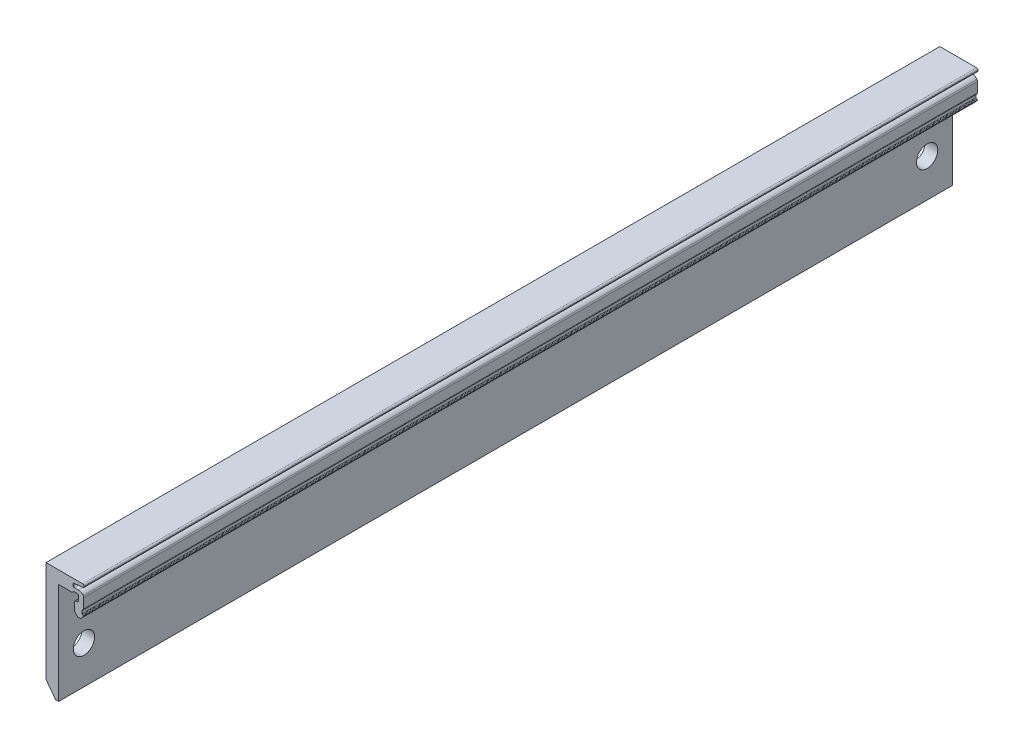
ISO-10303-21;
HEADER;
FILE_DESCRIPTION(('STEP AP214'),'2;1');
FILE_NAME('part.step','',(''),(''),'','','');
FILE_SCHEMA(('AUTOMOTIVE_DESIGN { 1 0 10303 214 1 1 1 1 }'));
ENDSEC;
DATA;
#1=APPLICATION_CONTEXT('core data for automotive mechanical design processes');
#2=APPLICATION_PROTOCOL_DEFINITION('international standard','automotive_design',2000,#1);
#3=PRODUCT_CONTEXT('',#1,'mechanical');
#4=PRODUCT('Part','Part','',(#3));
#5=PRODUCT_RELATED_PRODUCT_CATEGORY('part','',(#4));
#6=PRODUCT_DEFINITION_FORMATION('','',#4);
#7=PRODUCT_DEFINITION_CONTEXT('part definition',#1,'design');
#8=PRODUCT_DEFINITION('design','',#6,#7);
#9=PRODUCT_DEFINITION_SHAPE('','',#8);
#10=(LENGTH_UNIT() NAMED_UNIT(*) SI_UNIT(.MILLI.,.METRE.));
#11=(NAMED_UNIT(*) PLANE_ANGLE_UNIT() SI_UNIT($,.RADIAN.));
#12=(NAMED_UNIT(*) SI_UNIT($,.STERADIAN.) SOLID_ANGLE_UNIT());
#13=UNCERTAINTY_MEASURE_WITH_UNIT(LENGTH_MEASURE(1.E-05),#10,'distance_accuracy_value','');
#14=(GEOMETRIC_REPRESENTATION_CONTEXT(3) GLOBAL_UNCERTAINTY_ASSIGNED_CONTEXT((#13)) GLOBAL_UNIT_ASSIGNED_CONTEXT((#10,
#11,#12)) REPRESENTATION_CONTEXT('',''));
#15=CARTESIAN_POINT('',(0.,0.,0.));
#16=DIRECTION('',(0.,0.,1.));
#17=DIRECTION('',(1.,0.,0.));
#18=AXIS2_PLACEMENT_3D('',#15,#16,#17);
#19=CARTESIAN_POINT('',(2350.3840351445,-3290.10376988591,88.225));
#20=DIRECTION('',(0.,-1.,0.));
#21=DIRECTION('',(0.,0.,-1.));
#22=AXIS2_PLACEMENT_3D('',#19,#20,#21);
#23=PLANE('',#22);
#24=DIRECTION('',(-1.,0.,0.));
#25=VECTOR('',#24,1.);
#26=CARTESIAN_POINT('',(2350.3840351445,-3290.10376988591,-88.225));
#27=LINE('',#26,#25);
#28=CARTESIAN_POINT('',(2357.62403514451,-3290.10376988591,-88.225));
#29=VERTEX_POINT('',#28);
#30=CARTESIAN_POINT('',(2350.3840351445,-3290.10376988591,-88.225));
#31=VERTEX_POINT('',#30);
#32=EDGE_CURVE('E178',#29,#31,#27,.T.);
#33=ORIENTED_EDGE('',*,*,#32,.T.);
#34=DIRECTION('',(0.,0.,-1.));
#35=VECTOR('',#34,1.);
#36=CARTESIAN_POINT('',(2350.3840351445,-3290.10376988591,88.225));
#37=LINE('',#36,#35);
#38=CARTESIAN_POINT('',(2350.3840351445,-3290.10376988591,88.225));
#39=VERTEX_POINT('',#38);
#40=EDGE_CURVE('E11',#39,#31,#37,.T.);
#41=ORIENTED_EDGE('',*,*,#40,.F.);
#42=DIRECTION('',(-1.,0.,0.));
#43=VECTOR('',#42,1.);
#44=CARTESIAN_POINT('',(2355.38403514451,-3290.10376988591,88.225));
#45=LINE('',#44,#43);
#46=CARTESIAN_POINT('',(2357.62403514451,-3290.10376988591,88.225));
#47=VERTEX_POINT('',#46);
#48=EDGE_CURVE('E184',#47,#39,#45,.T.);
#49=ORIENTED_EDGE('',*,*,#48,.F.);
#50=DIRECTION('',(0.,0.,-1.));
#51=VECTOR('',#50,1.);
#52=CARTESIAN_POINT('',(2357.62403514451,-3290.10376988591,88.225));
#53=LINE('',#52,#51);
#54=EDGE_CURVE('E308',#47,#29,#53,.T.);
#55=ORIENTED_EDGE('',*,*,#54,.T.);
#56=EDGE_LOOP('',(#33,#41,#49,#55));
#57=FACE_BOUND('',#56,.T.);
#58=ADVANCED_FACE('F34',(#57),#23,.F.);
#59=CARTESIAN_POINT('',(2350.3840351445,-3292.60376988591,88.225));
#60=DIRECTION('',(1.,0.,0.));
#61=DIRECTION('',(0.,0.,-1.));
#62=AXIS2_PLACEMENT_3D('',#59,#60,#61);
#63=PLANE('',#62);
#64=CARTESIAN_POINT('',(2350.38403514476,-3305.10376988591,83.225));
#65=DIRECTION('',(-1.,0.,0.));
#66=DIRECTION('',(0.,1.,0.));
#67=AXIS2_PLACEMENT_3D('',#64,#65,#66);
#68=CIRCLE('',#67,2.09999999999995);
#69=CARTESIAN_POINT('',(2350.38403514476,-3303.00376988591,83.225));
#70=VERTEX_POINT('',#69);
#71=EDGE_CURVE('E497',#70,#70,#68,.T.);
#72=ORIENTED_EDGE('',*,*,#71,.F.);
#73=EDGE_LOOP('',(#72));
#74=FACE_BOUND('',#73,.T.);
#75=CARTESIAN_POINT('',(2350.38403514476,-3305.10376988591,-83.225));
#76=DIRECTION('',(-1.,0.,0.));
#77=DIRECTION('',(0.,-1.,0.));
#78=AXIS2_PLACEMENT_3D('',#75,#76,#77);
#79=CIRCLE('',#78,2.09999999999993);
#80=CARTESIAN_POINT('',(2350.38403514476,-3307.20376988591,-83.225));
#81=VERTEX_POINT('',#80);
#82=EDGE_CURVE('E489',#81,#81,#79,.T.);
#83=ORIENTED_EDGE('',*,*,#82,.F.);
#84=EDGE_LOOP('',(#83));
#85=FACE_BOUND('',#84,.T.);
#86=DIRECTION('',(0.,-1.,0.));
#87=VECTOR('',#86,1.);
#88=CARTESIAN_POINT('',(2350.3840351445,-3292.60376988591,-88.225));
#89=LINE('',#88,#87);
#90=CARTESIAN_POINT('',(2350.3840351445,-3310.10376988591,-88.225));
#91=VERTEX_POINT('',#90);
#92=EDGE_CURVE('E313',#31,#91,#89,.T.);
#93=ORIENTED_EDGE('',*,*,#92,.T.);
#94=DIRECTION('',(0.,0.,-1.));
#95=VECTOR('',#94,1.);
#96=CARTESIAN_POINT('',(2350.3840351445,-3310.10376988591,88.225));
#97=LINE('',#96,#95);
#98=CARTESIAN_POINT('',(2350.3840351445,-3310.10376988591,88.225));
#99=VERTEX_POINT('',#98);
#100=EDGE_CURVE('E43',#99,#91,#97,.T.);
#101=ORIENTED_EDGE('',*,*,#100,.F.);
#102=DIRECTION('',(0.,-1.,0.));
#103=VECTOR('',#102,1.);
#104=CARTESIAN_POINT('',(2350.3840351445,-3292.60376988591,88.225));
#105=LINE('',#104,#103);
#106=EDGE_CURVE('E501',#39,#99,#105,.T.);
#107=ORIENTED_EDGE('',*,*,#106,.F.);
#108=ORIENTED_EDGE('',*,*,#40,.T.);
#109=EDGE_LOOP('',(#93,#101,#107,#108));
#110=FACE_BOUND('',#109,.T.);
#111=ADVANCED_FACE('F583',(#74,#85,#110),#63,.F.);
#112=CARTESIAN_POINT('',(2350.3840351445,-3310.10376988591,88.225));
#113=DIRECTION('',(0.796162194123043,0.605083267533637,0.));
#114=DIRECTION('',(-0.605083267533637,0.796162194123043,0.));
#115=AXIS2_PLACEMENT_3D('',#112,#113,#114);
#116=PLANE('',#115);
#117=DIRECTION('',(0.605083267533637,-0.796162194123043,0.));
#118=VECTOR('',#117,1.);
#119=CARTESIAN_POINT('',(2350.3840351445,-3310.10376988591,-88.225));
#120=LINE('',#119,#118);
#121=CARTESIAN_POINT('',(2352.2840351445,-3312.60376988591,-88.225));
#122=VERTEX_POINT('',#121);
#123=EDGE_CURVE('E316',#91,#122,#120,.T.);
#124=ORIENTED_EDGE('',*,*,#123,.T.);
#125=DIRECTION('',(0.,0.,-1.));
#126=VECTOR('',#125,1.);
#127=CARTESIAN_POINT('',(2352.2840351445,-3312.60376988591,88.225));
#128=LINE('',#127,#126);
#129=CARTESIAN_POINT('',(2352.2840351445,-3312.60376988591,88.225));
#130=VERTEX_POINT('',#129);
#131=EDGE_CURVE('E484',#130,#122,#128,.T.);
#132=ORIENTED_EDGE('',*,*,#131,.F.);
#133=DIRECTION('',(0.605083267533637,-0.796162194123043,0.));
#134=VECTOR('',#133,1.);
#135=CARTESIAN_POINT('',(2350.3840351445,-3310.10376988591,88.225));
#136=LINE('',#135,#134);
#137=EDGE_CURVE('E503',#99,#130,#136,.T.);
#138=ORIENTED_EDGE('',*,*,#137,.F.);
#139=ORIENTED_EDGE('',*,*,#100,.T.);
#140=EDGE_LOOP('',(#124,#132,#138,#139));
#141=FACE_BOUND('',#140,.T.);
#142=ADVANCED_FACE('F589',(#141),#116,.F.);
#143=CARTESIAN_POINT('',(2352.8840351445,-3312.60376988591,88.225));
#144=DIRECTION('',(0.,1.,0.));
#145=DIRECTION('',(0.,0.,1.));
#146=AXIS2_PLACEMENT_3D('',#143,#144,#145);
#147=PLANE('',#146);
#148=DIRECTION('',(1.,0.,0.));
#149=VECTOR('',#148,1.);
#150=CARTESIAN_POINT('',(2352.8840351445,-3312.60376988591,-88.225));
#151=LINE('',#150,#149);
#152=CARTESIAN_POINT('',(2352.8840351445,-3312.60376988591,-88.225));
#153=VERTEX_POINT('',#152);
#154=EDGE_CURVE('E318',#122,#153,#151,.T.);
#155=ORIENTED_EDGE('',*,*,#154,.T.);
#156=DIRECTION('',(0.,0.,-1.));
#157=VECTOR('',#156,1.);
#158=CARTESIAN_POINT('',(2352.8840351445,-3312.60376988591,88.225));
#159=LINE('',#158,#157);
#160=CARTESIAN_POINT('',(2352.8840351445,-3312.60376988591,88.225));
#161=VERTEX_POINT('',#160);
#162=EDGE_CURVE('E481',#161,#153,#159,.T.);
#163=ORIENTED_EDGE('',*,*,#162,.F.);
#164=DIRECTION('',(1.,0.,0.));
#165=VECTOR('',#164,1.);
#166=CARTESIAN_POINT('',(2352.8840351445,-3312.60376988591,88.225));
#167=LINE('',#166,#165);
#168=EDGE_CURVE('E505',#130,#161,#167,.T.);
#169=ORIENTED_EDGE('',*,*,#168,.F.);
#170=ORIENTED_EDGE('',*,*,#131,.T.);
#171=EDGE_LOOP('',(#155,#163,#169,#170));
#172=FACE_BOUND('',#171,.T.);
#173=ADVANCED_FACE('F593',(#172),#147,.F.);
#174=CARTESIAN_POINT('',(2352.88403514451,-3292.60376988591,88.225));
#175=DIRECTION('',(-1.,0.,0.));
#176=DIRECTION('',(0.,-1.,0.));
#177=AXIS2_PLACEMENT_3D('',#174,#175,#176);
#178=PLANE('',#177);
#179=CARTESIAN_POINT('',(2352.88403514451,-3305.10376988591,83.225));
#180=DIRECTION('',(-1.,0.,0.));
#181=DIRECTION('',(0.,-1.,0.));
#182=AXIS2_PLACEMENT_3D('',#179,#180,#181);
#183=CIRCLE('',#182,2.09999999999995);
#184=CARTESIAN_POINT('',(2352.88403514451,-3307.20376988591,83.225));
#185=VERTEX_POINT('',#184);
#186=EDGE_CURVE('E37',#185,#185,#183,.T.);
#187=ORIENTED_EDGE('',*,*,#186,.T.);
#188=EDGE_LOOP('',(#187));
#189=FACE_BOUND('',#188,.T.);
#190=CARTESIAN_POINT('',(2352.88403514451,-3305.10376988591,-83.225));
#191=DIRECTION('',(-1.,0.,0.));
#192=DIRECTION('',(0.,-1.,0.));
#193=AXIS2_PLACEMENT_3D('',#190,#191,#192);
#194=CIRCLE('',#193,2.09999999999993);
#195=CARTESIAN_POINT('',(2352.88403514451,-3307.20376988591,-83.225));
#196=VERTEX_POINT('',#195);
#197=EDGE_CURVE('E314',#196,#196,#194,.T.);
#198=ORIENTED_EDGE('',*,*,#197,.T.);
#199=EDGE_LOOP('',(#198));
#200=FACE_BOUND('',#199,.T.);
#201=DIRECTION('',(0.,1.,0.));
#202=VECTOR('',#201,1.);
#203=CARTESIAN_POINT('',(2352.88403514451,-3292.60376988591,-88.225));
#204=LINE('',#203,#202);
#205=CARTESIAN_POINT('',(2352.88403514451,-3292.60376988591,-88.225));
#206=VERTEX_POINT('',#205);
#207=EDGE_CURVE('E320',#153,#206,#204,.T.);
#208=ORIENTED_EDGE('',*,*,#207,.T.);
#209=DIRECTION('',(0.,0.,-1.));
#210=VECTOR('',#209,1.);
#211=CARTESIAN_POINT('',(2352.88403514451,-3292.60376988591,88.225));
#212=LINE('',#211,#210);
#213=CARTESIAN_POINT('',(2352.88403514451,-3292.60376988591,88.225));
#214=VERTEX_POINT('',#213);
#215=EDGE_CURVE('E478',#214,#206,#212,.T.);
#216=ORIENTED_EDGE('',*,*,#215,.F.);
#217=DIRECTION('',(0.,1.,0.));
#218=VECTOR('',#217,1.);
#219=CARTESIAN_POINT('',(2352.88403514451,-3292.60376988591,88.225));
#220=LINE('',#219,#218);
#221=EDGE_CURVE('E507',#161,#214,#220,.T.);
#222=ORIENTED_EDGE('',*,*,#221,.F.);
#223=ORIENTED_EDGE('',*,*,#162,.T.);
#224=EDGE_LOOP('',(#208,#216,#222,#223));
#225=FACE_BOUND('',#224,.T.);
#226=ADVANCED_FACE('F598',(#189,#200,#225),#178,.F.);
#227=CARTESIAN_POINT('',(2355.38403514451,-3292.60376988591,88.225));
#228=DIRECTION('',(0.,1.,0.));
#229=DIRECTION('',(0.,0.,1.));
#230=AXIS2_PLACEMENT_3D('',#227,#228,#229);
#231=PLANE('',#230);
#232=DIRECTION('',(1.,0.,0.));
#233=VECTOR('',#232,1.);
#234=CARTESIAN_POINT('',(2355.38403514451,-3292.60376988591,-88.225));
#235=LINE('',#234,#233);
#236=CARTESIAN_POINT('',(2355.46834905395,-3292.60376988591,-88.225));
#237=VERTEX_POINT('',#236);
#238=EDGE_CURVE('E323',#206,#237,#235,.T.);
#239=ORIENTED_EDGE('',*,*,#238,.T.);
#240=DIRECTION('',(0.,0.,-1.));
#241=VECTOR('',#240,1.);
#242=CARTESIAN_POINT('',(2355.46834905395,-3292.60376988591,88.225));
#243=LINE('',#242,#241);
#244=CARTESIAN_POINT('',(2355.46834905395,-3292.60376988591,88.225));
#245=VERTEX_POINT('',#244);
#246=EDGE_CURVE('E475',#245,#237,#243,.T.);
#247=ORIENTED_EDGE('',*,*,#246,.F.);
#248=DIRECTION('',(1.,-3.55271367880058E-13,0.));
#249=VECTOR('',#248,1.);
#250=CARTESIAN_POINT('',(2352.88403514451,-3292.60376988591,88.225));
#251=LINE('',#250,#249);
#252=EDGE_CURVE('E509',#214,#245,#251,.T.);
#253=ORIENTED_EDGE('',*,*,#252,.F.);
#254=ORIENTED_EDGE('',*,*,#215,.T.);
#255=EDGE_LOOP('',(#239,#247,#253,#254));
#256=FACE_BOUND('',#255,.T.);
#257=ADVANCED_FACE('F604',(#256),#231,.F.);
#258=CARTESIAN_POINT('',(2355.46834905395,-3292.30376988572,88.225));
#259=DIRECTION('',(0.,0.,-1.));
#260=DIRECTION('',(-1.,0.,0.));
#261=AXIS2_PLACEMENT_3D('',#258,#259,#260);
#262=CYLINDRICAL_SURFACE('',#261,0.300000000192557);
#263=CARTESIAN_POINT('',(2355.46834905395,-3292.30376988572,-88.225));
#264=DIRECTION('',(0.,0.,1.));
#265=DIRECTION('',(-1.,0.,0.));
#266=AXIS2_PLACEMENT_3D('',#263,#264,#265);
#267=CIRCLE('',#266,0.300000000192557);
#268=CARTESIAN_POINT('',(2355.72815667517,-3292.45376988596,-88.225));
#269=VERTEX_POINT('',#268);
#270=EDGE_CURVE('E325',#237,#269,#267,.T.);
#271=ORIENTED_EDGE('',*,*,#270,.T.);
#272=DIRECTION('',(0.,0.,-1.));
#273=VECTOR('',#272,1.);
#274=CARTESIAN_POINT('',(2355.72815667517,-3292.45376988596,88.225));
#275=LINE('',#274,#273);
#276=CARTESIAN_POINT('',(2355.72815667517,-3292.45376988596,88.225));
#277=VERTEX_POINT('',#276);
#278=EDGE_CURVE('E472',#277,#269,#275,.T.);
#279=ORIENTED_EDGE('',*,*,#278,.F.);
#280=CARTESIAN_POINT('',(2355.46834905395,-3292.30376988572,88.225));
#281=DIRECTION('',(0.,0.,1.));
#282=DIRECTION('',(-1.,0.,0.));
#283=AXIS2_PLACEMENT_3D('',#280,#281,#282);
#284=CIRCLE('',#283,0.300000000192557);
#285=EDGE_CURVE('E511',#245,#277,#284,.T.);
#286=ORIENTED_EDGE('',*,*,#285,.F.);
#287=ORIENTED_EDGE('',*,*,#246,.T.);
#288=EDGE_LOOP('',(#271,#279,#286,#287));
#289=FACE_BOUND('',#288,.T.);
#290=ADVANCED_FACE('F607',(#289),#262,.T.);
#291=CARTESIAN_POINT('',(2355.9879642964,-3292.60376988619,88.225));
#292=DIRECTION('',(0.,0.,-1.));
#293=DIRECTION('',(-1.,0.,0.));
#294=AXIS2_PLACEMENT_3D('',#291,#292,#293);
#295=CYLINDRICAL_SURFACE('',#294,0.300000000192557);
#296=CARTESIAN_POINT('',(2355.9879642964,-3292.60376988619,-88.225));
#297=DIRECTION('',(0.,0.,-1.));
#298=DIRECTION('',(-1.,0.,0.));
#299=AXIS2_PLACEMENT_3D('',#296,#297,#298);
#300=CIRCLE('',#299,0.300000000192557);
#301=CARTESIAN_POINT('',(2355.9879642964,-3292.303769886,-88.225));
#302=VERTEX_POINT('',#301);
#303=EDGE_CURVE('E327',#269,#302,#300,.T.);
#304=ORIENTED_EDGE('',*,*,#303,.T.);
#305=DIRECTION('',(0.,0.,-1.));
#306=VECTOR('',#305,1.);
#307=CARTESIAN_POINT('',(2355.9879642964,-3292.303769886,88.225));
#308=LINE('',#307,#306);
#309=CARTESIAN_POINT('',(2355.9879642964,-3292.303769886,88.225));
#310=VERTEX_POINT('',#309);
#311=EDGE_CURVE('E469',#310,#302,#308,.T.);
#312=ORIENTED_EDGE('',*,*,#311,.F.);
#313=CARTESIAN_POINT('',(2355.9879642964,-3292.60376988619,88.225));
#314=DIRECTION('',(0.,0.,-1.));
#315=DIRECTION('',(-1.,0.,0.));
#316=AXIS2_PLACEMENT_3D('',#313,#314,#315);
#317=CIRCLE('',#316,0.300000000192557);
#318=EDGE_CURVE('E513',#277,#310,#317,.T.);
#319=ORIENTED_EDGE('',*,*,#318,.F.);
#320=ORIENTED_EDGE('',*,*,#278,.T.);
#321=EDGE_LOOP('',(#304,#312,#319,#320));
#322=FACE_BOUND('',#321,.T.);
#323=ADVANCED_FACE('F612',(#322),#295,.F.);
#324=CARTESIAN_POINT('',(2356.52403514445,-3292.303769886,88.225));
#325=DIRECTION('',(0.,1.,0.));
#326=DIRECTION('',(0.,0.,1.));
#327=AXIS2_PLACEMENT_3D('',#324,#325,#326);
#328=PLANE('',#327);
#329=DIRECTION('',(1.,0.,0.));
#330=VECTOR('',#329,1.);
#331=CARTESIAN_POINT('',(2356.52403514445,-3292.303769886,-88.225));
#332=LINE('',#331,#330);
#333=CARTESIAN_POINT('',(2356.52403514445,-3292.303769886,-88.225));
#334=VERTEX_POINT('',#333);
#335=EDGE_CURVE('E329',#302,#334,#332,.T.);
#336=ORIENTED_EDGE('',*,*,#335,.T.);
#337=DIRECTION('',(0.,0.,-1.));
#338=VECTOR('',#337,1.);
#339=CARTESIAN_POINT('',(2356.52403514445,-3292.303769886,88.225));
#340=LINE('',#339,#338);
#341=CARTESIAN_POINT('',(2356.52403514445,-3292.303769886,88.225));
#342=VERTEX_POINT('',#341);
#343=EDGE_CURVE('E466',#342,#334,#340,.T.);
#344=ORIENTED_EDGE('',*,*,#343,.F.);
#345=DIRECTION('',(1.,0.,0.));
#346=VECTOR('',#345,1.);
#347=CARTESIAN_POINT('',(2356.52403514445,-3292.303769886,88.225));
#348=LINE('',#347,#346);
#349=EDGE_CURVE('E515',#310,#342,#348,.T.);
#350=ORIENTED_EDGE('',*,*,#349,.F.);
#351=ORIENTED_EDGE('',*,*,#311,.T.);
#352=EDGE_LOOP('',(#336,#344,#350,#351));
#353=FACE_BOUND('',#352,.T.);
#354=ADVANCED_FACE('F618',(#353),#328,.F.);
#355=CARTESIAN_POINT('',(2356.52403514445,-3292.603769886,88.225));
#356=DIRECTION('',(0.,0.,-1.));
#357=DIRECTION('',(-1.,0.,0.));
#358=AXIS2_PLACEMENT_3D('',#355,#356,#357);
#359=CYLINDRICAL_SURFACE('',#358,0.300000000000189);
#360=CARTESIAN_POINT('',(2356.52403514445,-3292.603769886,-88.225));
#361=DIRECTION('',(0.,0.,-1.));
#362=DIRECTION('',(-1.,0.,0.));
#363=AXIS2_PLACEMENT_3D('',#360,#361,#362);
#364=CIRCLE('',#363,0.300000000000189);
#365=CARTESIAN_POINT('',(2356.82403514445,-3292.603769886,-88.225));
#366=VERTEX_POINT('',#365);
#367=EDGE_CURVE('E331',#334,#366,#364,.T.);
#368=ORIENTED_EDGE('',*,*,#367,.T.);
#369=DIRECTION('',(0.,0.,-1.));
#370=VECTOR('',#369,1.);
#371=CARTESIAN_POINT('',(2356.82403514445,-3292.603769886,88.225));
#372=LINE('',#371,#370);
#373=CARTESIAN_POINT('',(2356.82403514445,-3292.603769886,88.225));
#374=VERTEX_POINT('',#373);
#375=EDGE_CURVE('E463',#374,#366,#372,.T.);
#376=ORIENTED_EDGE('',*,*,#375,.F.);
#377=CARTESIAN_POINT('',(2356.52403514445,-3292.603769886,88.225));
#378=DIRECTION('',(0.,0.,-1.));
#379=DIRECTION('',(-1.,0.,0.));
#380=AXIS2_PLACEMENT_3D('',#377,#378,#379);
#381=CIRCLE('',#380,0.300000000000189);
#382=EDGE_CURVE('E517',#342,#374,#381,.T.);
#383=ORIENTED_EDGE('',*,*,#382,.F.);
#384=ORIENTED_EDGE('',*,*,#343,.T.);
#385=EDGE_LOOP('',(#368,#376,#383,#384));
#386=FACE_BOUND('',#385,.T.);
#387=ADVANCED_FACE('F622',(#386),#359,.F.);
#388=CARTESIAN_POINT('',(2356.82403514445,-3293.40376988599,88.225));
#389=DIRECTION('',(1.,0.,0.));
#390=DIRECTION('',(0.,0.,-1.));
#391=AXIS2_PLACEMENT_3D('',#388,#389,#390);
#392=PLANE('',#391);
#393=DIRECTION('',(0.,-1.,0.));
#394=VECTOR('',#393,1.);
#395=CARTESIAN_POINT('',(2356.82403514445,-3293.40376988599,-88.225));
#396=LINE('',#395,#394);
#397=CARTESIAN_POINT('',(2356.82403514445,-3293.40376988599,-88.225));
#398=VERTEX_POINT('',#397);
#399=EDGE_CURVE('E333',#366,#398,#396,.T.);
#400=ORIENTED_EDGE('',*,*,#399,.T.);
#401=DIRECTION('',(0.,0.,-1.));
#402=VECTOR('',#401,1.);
#403=CARTESIAN_POINT('',(2356.82403514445,-3293.40376988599,88.225));
#404=LINE('',#403,#402);
#405=CARTESIAN_POINT('',(2356.82403514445,-3293.40376988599,88.225));
#406=VERTEX_POINT('',#405);
#407=EDGE_CURVE('E460',#406,#398,#404,.T.);
#408=ORIENTED_EDGE('',*,*,#407,.F.);
#409=DIRECTION('',(0.,-1.,0.));
#410=VECTOR('',#409,1.);
#411=CARTESIAN_POINT('',(2356.82403514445,-3293.40376988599,88.225));
#412=LINE('',#411,#410);
#413=EDGE_CURVE('E519',#374,#406,#412,.T.);
#414=ORIENTED_EDGE('',*,*,#413,.F.);
#415=ORIENTED_EDGE('',*,*,#375,.T.);
#416=EDGE_LOOP('',(#400,#408,#414,#415));
#417=FACE_BOUND('',#416,.T.);
#418=ADVANCED_FACE('F627',(#417),#392,.F.);
#419=CARTESIAN_POINT('',(2356.52403514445,-3293.40376988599,88.225));
#420=DIRECTION('',(0.,0.,-1.));
#421=DIRECTION('',(-1.,0.,0.));
#422=AXIS2_PLACEMENT_3D('',#419,#420,#421);
#423=CYLINDRICAL_SURFACE('',#422,0.300000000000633);
#424=CARTESIAN_POINT('',(2356.52403514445,-3293.40376988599,-88.225));
#425=DIRECTION('',(0.,0.,-1.));
#426=DIRECTION('',(-1.,0.,0.));
#427=AXIS2_PLACEMENT_3D('',#424,#425,#426);
#428=CIRCLE('',#427,0.300000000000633);
#429=CARTESIAN_POINT('',(2356.52403514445,-3293.70376988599,-88.225));
#430=VERTEX_POINT('',#429);
#431=EDGE_CURVE('E335',#398,#430,#428,.T.);
#432=ORIENTED_EDGE('',*,*,#431,.T.);
#433=DIRECTION('',(0.,0.,-1.));
#434=VECTOR('',#433,1.);
#435=CARTESIAN_POINT('',(2356.52403514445,-3293.70376988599,88.225));
#436=LINE('',#435,#434);
#437=CARTESIAN_POINT('',(2356.52403514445,-3293.70376988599,88.225));
#438=VERTEX_POINT('',#437);
#439=EDGE_CURVE('E457',#438,#430,#436,.T.);
#440=ORIENTED_EDGE('',*,*,#439,.F.);
#441=CARTESIAN_POINT('',(2356.52403514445,-3293.40376988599,88.225));
#442=DIRECTION('',(0.,0.,-1.));
#443=DIRECTION('',(-1.,0.,0.));
#444=AXIS2_PLACEMENT_3D('',#441,#442,#443);
#445=CIRCLE('',#444,0.300000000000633);
#446=EDGE_CURVE('E521',#406,#438,#445,.T.);
#447=ORIENTED_EDGE('',*,*,#446,.F.);
#448=ORIENTED_EDGE('',*,*,#407,.T.);
#449=EDGE_LOOP('',(#432,#440,#447,#448));
#450=FACE_BOUND('',#449,.T.);
#451=ADVANCED_FACE('F633',(#450),#423,.F.);
#452=CARTESIAN_POINT('',(2356.32403514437,-3293.70376988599,88.225));
#453=DIRECTION('',(0.,-1.,0.));
#454=DIRECTION('',(0.,0.,-1.));
#455=AXIS2_PLACEMENT_3D('',#452,#453,#454);
#456=PLANE('',#455);
#457=DIRECTION('',(-1.,0.,0.));
#458=VECTOR('',#457,1.);
#459=CARTESIAN_POINT('',(2356.32403514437,-3293.70376988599,-88.225));
#460=LINE('',#459,#458);
#461=CARTESIAN_POINT('',(2356.32403514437,-3293.70376988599,-88.225));
#462=VERTEX_POINT('',#461);
#463=EDGE_CURVE('E337',#430,#462,#460,.T.);
#464=ORIENTED_EDGE('',*,*,#463,.T.);
#465=DIRECTION('',(0.,0.,-1.));
#466=VECTOR('',#465,1.);
#467=CARTESIAN_POINT('',(2356.32403514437,-3293.70376988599,88.225));
#468=LINE('',#467,#466);
#469=CARTESIAN_POINT('',(2356.32403514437,-3293.70376988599,88.225));
#470=VERTEX_POINT('',#469);
#471=EDGE_CURVE('E454',#470,#462,#468,.T.);
#472=ORIENTED_EDGE('',*,*,#471,.F.);
#473=DIRECTION('',(-1.,0.,0.));
#474=VECTOR('',#473,1.);
#475=CARTESIAN_POINT('',(2356.32403514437,-3293.70376988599,88.225));
#476=LINE('',#475,#474);
#477=EDGE_CURVE('E523',#438,#470,#476,.T.);
#478=ORIENTED_EDGE('',*,*,#477,.F.);
#479=ORIENTED_EDGE('',*,*,#439,.T.);
#480=EDGE_LOOP('',(#464,#472,#478,#479));
#481=FACE_BOUND('',#480,.T.);
#482=ADVANCED_FACE('F637',(#481),#456,.F.);
#483=CARTESIAN_POINT('',(2356.32403514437,-3294.003769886,88.225));
#484=DIRECTION('',(0.,0.,-1.));
#485=DIRECTION('',(-1.,0.,0.));
#486=AXIS2_PLACEMENT_3D('',#483,#484,#485);
#487=CYLINDRICAL_SURFACE('',#486,0.300000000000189);
#488=CARTESIAN_POINT('',(2356.32403514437,-3294.003769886,-88.225));
#489=DIRECTION('',(0.,0.,1.));
#490=DIRECTION('',(-1.,0.,0.));
#491=AXIS2_PLACEMENT_3D('',#488,#489,#490);
#492=CIRCLE('',#491,0.300000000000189);
#493=CARTESIAN_POINT('',(2356.02403514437,-3294.003769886,-88.225));
#494=VERTEX_POINT('',#493);
#495=EDGE_CURVE('E339',#462,#494,#492,.T.);
#496=ORIENTED_EDGE('',*,*,#495,.T.);
#497=DIRECTION('',(0.,0.,-1.));
#498=VECTOR('',#497,1.);
#499=CARTESIAN_POINT('',(2356.02403514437,-3294.003769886,88.225));
#500=LINE('',#499,#498);
#501=CARTESIAN_POINT('',(2356.02403514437,-3294.003769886,88.225));
#502=VERTEX_POINT('',#501);
#503=EDGE_CURVE('E451',#502,#494,#500,.T.);
#504=ORIENTED_EDGE('',*,*,#503,.F.);
#505=CARTESIAN_POINT('',(2356.32403514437,-3294.003769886,88.225));
#506=DIRECTION('',(0.,0.,1.));
#507=DIRECTION('',(-1.,0.,0.));
#508=AXIS2_PLACEMENT_3D('',#505,#506,#507);
#509=CIRCLE('',#508,0.300000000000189);
#510=EDGE_CURVE('E525',#470,#502,#509,.T.);
#511=ORIENTED_EDGE('',*,*,#510,.F.);
#512=ORIENTED_EDGE('',*,*,#471,.T.);
#513=EDGE_LOOP('',(#496,#504,#511,#512));
#514=FACE_BOUND('',#513,.T.);
#515=ADVANCED_FACE('F642',(#514),#487,.T.);
#516=CARTESIAN_POINT('',(2356.02403514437,-3295.45454467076,88.225));
#517=DIRECTION('',(1.,3.06104858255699E-13,0.));
#518=DIRECTION('',(-3.06104858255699E-13,1.,0.));
#519=AXIS2_PLACEMENT_3D('',#516,#517,#518);
#520=PLANE('',#519);
#521=DIRECTION('',(3.06104858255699E-13,-1.,0.));
#522=VECTOR('',#521,1.);
#523=CARTESIAN_POINT('',(2356.02403514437,-3295.45454467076,-88.225));
#524=LINE('',#523,#522);
#525=CARTESIAN_POINT('',(2356.02403514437,-3295.45454467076,-88.225));
#526=VERTEX_POINT('',#525);
#527=EDGE_CURVE('E341',#494,#526,#524,.T.);
#528=ORIENTED_EDGE('',*,*,#527,.T.);
#529=DIRECTION('',(0.,0.,-1.));
#530=VECTOR('',#529,1.);
#531=CARTESIAN_POINT('',(2356.02403514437,-3295.45454467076,88.225));
#532=LINE('',#531,#530);
#533=CARTESIAN_POINT('',(2356.02403514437,-3295.45454467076,88.225));
#534=VERTEX_POINT('',#533);
#535=EDGE_CURVE('E448',#534,#526,#532,.T.);
#536=ORIENTED_EDGE('',*,*,#535,.F.);
#537=DIRECTION('',(3.06104858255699E-13,-1.,0.));
#538=VECTOR('',#537,1.);
#539=CARTESIAN_POINT('',(2356.02403514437,-3295.45454467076,88.225));
#540=LINE('',#539,#538);
#541=EDGE_CURVE('E527',#502,#534,#540,.T.);
#542=ORIENTED_EDGE('',*,*,#541,.F.);
#543=ORIENTED_EDGE('',*,*,#503,.T.);
#544=EDGE_LOOP('',(#528,#536,#542,#543));
#545=FACE_BOUND('',#544,.T.);
#546=ADVANCED_FACE('F648',(#545),#520,.F.);
#547=CARTESIAN_POINT('',(2356.3240351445,-3295.45454467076,88.225));
#548=DIRECTION('',(0.,0.,-1.));
#549=DIRECTION('',(-1.,0.,0.));
#550=AXIS2_PLACEMENT_3D('',#547,#548,#549);
#551=CYLINDRICAL_SURFACE('',#550,0.300000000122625);
#552=CARTESIAN_POINT('',(2356.3240351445,-3295.45454467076,-88.225));
#553=DIRECTION('',(0.,0.,1.));
#554=DIRECTION('',(-1.,0.,0.));
#555=AXIS2_PLACEMENT_3D('',#552,#553,#554);
#556=CIRCLE('',#555,0.300000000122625);
#557=CARTESIAN_POINT('',(2356.09426057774,-3295.64742714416,-88.225));
#558=VERTEX_POINT('',#557);
#559=EDGE_CURVE('E343',#526,#558,#556,.T.);
#560=ORIENTED_EDGE('',*,*,#559,.T.);
#561=DIRECTION('',(0.,0.,-1.));
#562=VECTOR('',#561,1.);
#563=CARTESIAN_POINT('',(2356.09426057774,-3295.64742714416,88.225));
#564=LINE('',#563,#562);
#565=CARTESIAN_POINT('',(2356.09426057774,-3295.64742714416,88.225));
#566=VERTEX_POINT('',#565);
#567=EDGE_CURVE('E445',#566,#558,#564,.T.);
#568=ORIENTED_EDGE('',*,*,#567,.F.);
#569=CARTESIAN_POINT('',(2356.3240351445,-3295.45454467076,88.225));
#570=DIRECTION('',(0.,0.,1.));
#571=DIRECTION('',(-1.,0.,0.));
#572=AXIS2_PLACEMENT_3D('',#569,#570,#571);
#573=CIRCLE('',#572,0.300000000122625);
#574=EDGE_CURVE('E529',#534,#566,#573,.T.);
#575=ORIENTED_EDGE('',*,*,#574,.F.);
#576=ORIENTED_EDGE('',*,*,#535,.T.);
#577=EDGE_LOOP('',(#560,#568,#575,#576));
#578=FACE_BOUND('',#577,.T.);
#579=ADVANCED_FACE('F652',(#578),#551,.T.);
#580=CARTESIAN_POINT('',(2356.46501305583,-3296.08909241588,88.225));
#581=DIRECTION('',(0.765915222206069,0.642941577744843,0.));
#582=DIRECTION('',(-0.642941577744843,0.765915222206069,0.));
#583=AXIS2_PLACEMENT_3D('',#580,#581,#582);
#584=PLANE('',#583);
#585=DIRECTION('',(0.642941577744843,-0.765915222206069,0.));
#586=VECTOR('',#585,1.);
#587=CARTESIAN_POINT('',(2356.46501305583,-3296.08909241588,-88.225));
#588=LINE('',#587,#586);
#589=CARTESIAN_POINT('',(2356.46501305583,-3296.08909241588,-88.225));
#590=VERTEX_POINT('',#589);
#591=EDGE_CURVE('E345',#558,#590,#588,.T.);
#592=ORIENTED_EDGE('',*,*,#591,.T.);
#593=DIRECTION('',(0.,0.,-1.));
#594=VECTOR('',#593,1.);
#595=CARTESIAN_POINT('',(2356.46501305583,-3296.08909241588,88.225));
#596=LINE('',#595,#594);
#597=CARTESIAN_POINT('',(2356.46501305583,-3296.08909241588,88.225));
#598=VERTEX_POINT('',#597);
#599=EDGE_CURVE('E442',#598,#590,#596,.T.);
#600=ORIENTED_EDGE('',*,*,#599,.F.);
#601=DIRECTION('',(0.642941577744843,-0.765915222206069,0.));
#602=VECTOR('',#601,1.);
#603=CARTESIAN_POINT('',(2356.46501305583,-3296.08909241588,88.225));
#604=LINE('',#603,#602);
#605=EDGE_CURVE('E531',#566,#598,#604,.T.);
#606=ORIENTED_EDGE('',*,*,#605,.F.);
#607=ORIENTED_EDGE('',*,*,#567,.T.);
#608=EDGE_LOOP('',(#592,#600,#606,#607));
#609=FACE_BOUND('',#608,.T.);
#610=ADVANCED_FACE('F657',(#609),#584,.F.);
#611=CARTESIAN_POINT('',(2356.92403515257,-3295.703769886,88.225));
#612=DIRECTION('',(0.,0.,-1.));
#613=DIRECTION('',(-1.,0.,0.));
#614=AXIS2_PLACEMENT_3D('',#611,#612,#613);
#615=CYLINDRICAL_SURFACE('',#614,0.599311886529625);
#616=CARTESIAN_POINT('',(2356.92403515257,-3295.703769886,-88.225));
#617=DIRECTION('',(0.,0.,1.));
#618=DIRECTION('',(-1.,0.,0.));
#619=AXIS2_PLACEMENT_3D('',#616,#617,#618);
#620=CIRCLE('',#619,0.599311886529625);
#621=CARTESIAN_POINT('',(2357.38305725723,-3296.08909240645,-88.225));
#622=VERTEX_POINT('',#621);
#623=EDGE_CURVE('E347',#590,#622,#620,.T.);
#624=ORIENTED_EDGE('',*,*,#623,.T.);
#625=DIRECTION('',(0.,0.,-1.));
#626=VECTOR('',#625,1.);
#627=CARTESIAN_POINT('',(2357.38305725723,-3296.08909240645,88.225));
#628=LINE('',#627,#626);
#629=CARTESIAN_POINT('',(2357.38305725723,-3296.08909240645,88.225));
#630=VERTEX_POINT('',#629);
#631=EDGE_CURVE('E439',#630,#622,#628,.T.);
#632=ORIENTED_EDGE('',*,*,#631,.F.);
#633=CARTESIAN_POINT('',(2356.92403515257,-3295.703769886,88.225));
#634=DIRECTION('',(0.,0.,1.));
#635=DIRECTION('',(-1.,0.,0.));
#636=AXIS2_PLACEMENT_3D('',#633,#634,#635);
#637=CIRCLE('',#636,0.599311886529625);
#638=EDGE_CURVE('E533',#598,#630,#637,.T.);
#639=ORIENTED_EDGE('',*,*,#638,.F.);
#640=ORIENTED_EDGE('',*,*,#599,.T.);
#641=EDGE_LOOP('',(#624,#632,#639,#640));
#642=FACE_BOUND('',#641,.T.);
#643=ADVANCED_FACE('F663',(#642),#615,.T.);
#644=CARTESIAN_POINT('',(2357.80062666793,-3295.59165563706,88.225));
#645=DIRECTION('',(-0.765915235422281,0.642941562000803,0.));
#646=DIRECTION('',(-0.642941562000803,-0.765915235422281,0.));
#647=AXIS2_PLACEMENT_3D('',#644,#645,#646);
#648=PLANE('',#647);
#649=DIRECTION('',(0.642941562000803,0.765915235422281,0.));
#650=VECTOR('',#649,1.);
#651=CARTESIAN_POINT('',(2357.80062666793,-3295.59165563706,-88.225));
#652=LINE('',#651,#650);
#653=CARTESIAN_POINT('',(2357.80062666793,-3295.59165563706,-88.225));
#654=VERTEX_POINT('',#653);
#655=EDGE_CURVE('E349',#622,#654,#652,.T.);
#656=ORIENTED_EDGE('',*,*,#655,.T.);
#657=DIRECTION('',(0.,0.,-1.));
#658=VECTOR('',#657,1.);
#659=CARTESIAN_POINT('',(2357.80062666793,-3295.59165563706,88.225));
#660=LINE('',#659,#658);
#661=CARTESIAN_POINT('',(2357.80062666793,-3295.59165563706,88.225));
#662=VERTEX_POINT('',#661);
#663=EDGE_CURVE('E436',#662,#654,#660,.T.);
#664=ORIENTED_EDGE('',*,*,#663,.F.);
#665=DIRECTION('',(0.642941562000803,0.765915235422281,0.));
#666=VECTOR('',#665,1.);
#667=CARTESIAN_POINT('',(2357.80062666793,-3295.59165563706,88.225));
#668=LINE('',#667,#666);
#669=EDGE_CURVE('E535',#630,#662,#668,.T.);
#670=ORIENTED_EDGE('',*,*,#669,.F.);
#671=ORIENTED_EDGE('',*,*,#631,.T.);
#672=EDGE_LOOP('',(#656,#664,#670,#671));
#673=FACE_BOUND('',#672,.T.);
#674=ADVANCED_FACE('F667',(#673),#648,.F.);
#675=CARTESIAN_POINT('',(2357.7240351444,-3295.52736148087,88.225));
#676=DIRECTION('',(0.,0.,-1.));
#677=DIRECTION('',(-1.,0.,0.));
#678=AXIS2_PLACEMENT_3D('',#675,#676,#677);
#679=CYLINDRICAL_SURFACE('',#678,0.0999999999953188);
#680=CARTESIAN_POINT('',(2357.7240351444,-3295.52736148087,-88.225));
#681=DIRECTION('',(0.,0.,1.));
#682=DIRECTION('',(-1.,0.,0.));
#683=AXIS2_PLACEMENT_3D('',#680,#681,#682);
#684=CIRCLE('',#683,0.0999999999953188);
#685=CARTESIAN_POINT('',(2357.82403514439,-3295.52736148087,-88.225));
#686=VERTEX_POINT('',#685);
#687=EDGE_CURVE('E351',#654,#686,#684,.T.);
#688=ORIENTED_EDGE('',*,*,#687,.T.);
#689=DIRECTION('',(0.,0.,-1.));
#690=VECTOR('',#689,1.);
#691=CARTESIAN_POINT('',(2357.82403514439,-3295.52736148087,88.225));
#692=LINE('',#691,#690);
#693=CARTESIAN_POINT('',(2357.82403514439,-3295.52736148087,88.225));
#694=VERTEX_POINT('',#693);
#695=EDGE_CURVE('E433',#694,#686,#692,.T.);
#696=ORIENTED_EDGE('',*,*,#695,.F.);
#697=CARTESIAN_POINT('',(2357.7240351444,-3295.52736148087,88.225));
#698=DIRECTION('',(0.,0.,1.));
#699=DIRECTION('',(-1.,0.,0.));
#700=AXIS2_PLACEMENT_3D('',#697,#698,#699);
#701=CIRCLE('',#700,0.0999999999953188);
#702=EDGE_CURVE('E537',#662,#694,#701,.T.);
#703=ORIENTED_EDGE('',*,*,#702,.F.);
#704=ORIENTED_EDGE('',*,*,#663,.T.);
#705=EDGE_LOOP('',(#688,#696,#703,#704));
#706=FACE_BOUND('',#705,.T.);
#707=ADVANCED_FACE('F672',(#706),#679,.T.);
#708=CARTESIAN_POINT('',(2357.82403514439,-3295.50795991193,88.225));
#709=DIRECTION('',(-1.,0.,0.));
#710=DIRECTION('',(0.,0.,1.));
#711=AXIS2_PLACEMENT_3D('',#708,#709,#710);
#712=PLANE('',#711);
#713=DIRECTION('',(0.,1.,0.));
#714=VECTOR('',#713,1.);
#715=CARTESIAN_POINT('',(2357.82403514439,-3295.50795991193,-88.225));
#716=LINE('',#715,#714);
#717=CARTESIAN_POINT('',(2357.82403514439,-3295.50795991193,-88.225));
#718=VERTEX_POINT('',#717);
#719=EDGE_CURVE('E353',#686,#718,#716,.T.);
#720=ORIENTED_EDGE('',*,*,#719,.T.);
#721=DIRECTION('',(0.,0.,-1.));
#722=VECTOR('',#721,1.);
#723=CARTESIAN_POINT('',(2357.82403514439,-3295.50795991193,88.225));
#724=LINE('',#723,#722);
#725=CARTESIAN_POINT('',(2357.82403514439,-3295.50795991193,88.225));
#726=VERTEX_POINT('',#725);
#727=EDGE_CURVE('E430',#726,#718,#724,.T.);
#728=ORIENTED_EDGE('',*,*,#727,.F.);
#729=DIRECTION('',(0.,1.,0.));
#730=VECTOR('',#729,1.);
#731=CARTESIAN_POINT('',(2357.82403514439,-3295.50795991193,88.225));
#732=LINE('',#731,#730);
#733=EDGE_CURVE('E539',#694,#726,#732,.T.);
#734=ORIENTED_EDGE('',*,*,#733,.F.);
#735=ORIENTED_EDGE('',*,*,#695,.T.);
#736=EDGE_LOOP('',(#720,#728,#734,#735));
#737=FACE_BOUND('',#736,.T.);
#738=ADVANCED_FACE('F678',(#737),#712,.F.);
#739=CARTESIAN_POINT('',(2357.72403514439,-3295.50795991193,88.225));
#740=DIRECTION('',(0.,0.,-1.));
#741=DIRECTION('',(-1.,0.,0.));
#742=AXIS2_PLACEMENT_3D('',#739,#740,#741);
#743=CYLINDRICAL_SURFACE('',#742,0.0999999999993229);
#744=CARTESIAN_POINT('',(2357.72403514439,-3295.50795991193,-88.225));
#745=DIRECTION('',(0.,0.,1.));
#746=DIRECTION('',(-1.,0.,0.));
#747=AXIS2_PLACEMENT_3D('',#744,#745,#746);
#748=CIRCLE('',#747,0.0999999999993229);
#749=CARTESIAN_POINT('',(2357.72403514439,-3295.40795991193,-88.225));
#750=VERTEX_POINT('',#749);
#751=EDGE_CURVE('E355',#718,#750,#748,.T.);
#752=ORIENTED_EDGE('',*,*,#751,.T.);
#753=DIRECTION('',(0.,0.,-1.));
#754=VECTOR('',#753,1.);
#755=CARTESIAN_POINT('',(2357.72403514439,-3295.40795991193,88.225));
#756=LINE('',#755,#754);
#757=CARTESIAN_POINT('',(2357.72403514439,-3295.40795991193,88.225));
#758=VERTEX_POINT('',#757);
#759=EDGE_CURVE('E427',#758,#750,#756,.T.);
#760=ORIENTED_EDGE('',*,*,#759,.F.);
#761=CARTESIAN_POINT('',(2357.72403514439,-3295.50795991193,88.225));
#762=DIRECTION('',(0.,0.,1.));
#763=DIRECTION('',(-1.,0.,0.));
#764=AXIS2_PLACEMENT_3D('',#761,#762,#763);
#765=CIRCLE('',#764,0.0999999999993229);
#766=EDGE_CURVE('E541',#726,#758,#765,.T.);
#767=ORIENTED_EDGE('',*,*,#766,.F.);
#768=ORIENTED_EDGE('',*,*,#727,.T.);
#769=EDGE_LOOP('',(#752,#760,#767,#768));
#770=FACE_BOUND('',#769,.T.);
#771=ADVANCED_FACE('F682',(#770),#743,.T.);
#772=CARTESIAN_POINT('',(2357.59724022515,-3295.40795991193,88.225));
#773=DIRECTION('',(0.,-1.,0.));
#774=DIRECTION('',(0.,0.,-1.));
#775=AXIS2_PLACEMENT_3D('',#772,#773,#774);
#776=PLANE('',#775);
#777=DIRECTION('',(-1.,0.,0.));
#778=VECTOR('',#777,1.);
#779=CARTESIAN_POINT('',(2357.59724022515,-3295.40795991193,-88.225));
#780=LINE('',#779,#778);
#781=CARTESIAN_POINT('',(2357.59724022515,-3295.40795991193,-88.225));
#782=VERTEX_POINT('',#781);
#783=EDGE_CURVE('E357',#750,#782,#780,.T.);
#784=ORIENTED_EDGE('',*,*,#783,.T.);
#785=DIRECTION('',(0.,0.,-1.));
#786=VECTOR('',#785,1.);
#787=CARTESIAN_POINT('',(2357.59724022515,-3295.40795991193,88.225));
#788=LINE('',#787,#786);
#789=CARTESIAN_POINT('',(2357.59724022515,-3295.40795991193,88.225));
#790=VERTEX_POINT('',#789);
#791=EDGE_CURVE('E424',#790,#782,#788,.T.);
#792=ORIENTED_EDGE('',*,*,#791,.F.);
#793=DIRECTION('',(-1.,0.,0.));
#794=VECTOR('',#793,1.);
#795=CARTESIAN_POINT('',(2357.59724022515,-3295.40795991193,88.225));
#796=LINE('',#795,#794);
#797=EDGE_CURVE('E543',#758,#790,#796,.T.);
#798=ORIENTED_EDGE('',*,*,#797,.F.);
#799=ORIENTED_EDGE('',*,*,#759,.T.);
#800=EDGE_LOOP('',(#784,#792,#798,#799));
#801=FACE_BOUND('',#800,.T.);
#802=ADVANCED_FACE('F687',(#801),#776,.F.);
#803=CARTESIAN_POINT('',(2357.59724022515,-3295.30795991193,88.225));
#804=DIRECTION('',(0.,0.,-1.));
#805=DIRECTION('',(-1.,0.,0.));
#806=AXIS2_PLACEMENT_3D('',#803,#804,#805);
#807=CYLINDRICAL_SURFACE('',#806,0.0999999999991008);
#808=CARTESIAN_POINT('',(2357.59724022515,-3295.30795991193,-88.225));
#809=DIRECTION('',(0.,0.,-1.));
#810=DIRECTION('',(-1.,0.,0.));
#811=AXIS2_PLACEMENT_3D('',#808,#809,#810);
#812=CIRCLE('',#811,0.0999999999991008);
#813=CARTESIAN_POINT('',(2357.49724022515,-3295.30795991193,-88.225));
#814=VERTEX_POINT('',#813);
#815=EDGE_CURVE('E359',#782,#814,#812,.T.);
#816=ORIENTED_EDGE('',*,*,#815,.T.);
#817=DIRECTION('',(0.,0.,-1.));
#818=VECTOR('',#817,1.);
#819=CARTESIAN_POINT('',(2357.49724022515,-3295.30795991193,88.225));
#820=LINE('',#819,#818);
#821=CARTESIAN_POINT('',(2357.49724022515,-3295.30795991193,88.225));
#822=VERTEX_POINT('',#821);
#823=EDGE_CURVE('E421',#822,#814,#820,.T.);
#824=ORIENTED_EDGE('',*,*,#823,.F.);
#825=CARTESIAN_POINT('',(2357.59724022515,-3295.30795991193,88.225));
#826=DIRECTION('',(0.,0.,-1.));
#827=DIRECTION('',(-1.,0.,0.));
#828=AXIS2_PLACEMENT_3D('',#825,#826,#827);
#829=CIRCLE('',#828,0.0999999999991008);
#830=EDGE_CURVE('E545',#790,#822,#829,.T.);
#831=ORIENTED_EDGE('',*,*,#830,.F.);
#832=ORIENTED_EDGE('',*,*,#791,.T.);
#833=EDGE_LOOP('',(#816,#824,#831,#832));
#834=FACE_BOUND('',#833,.T.);
#835=ADVANCED_FACE('F693',(#834),#807,.F.);
#836=CARTESIAN_POINT('',(2357.49724022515,-3294.80795991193,88.225));
#837=DIRECTION('',(-1.,0.,0.));
#838=DIRECTION('',(0.,0.,1.));
#839=AXIS2_PLACEMENT_3D('',#836,#837,#838);
#840=PLANE('',#839);
#841=DIRECTION('',(0.,1.,0.));
#842=VECTOR('',#841,1.);
#843=CARTESIAN_POINT('',(2357.49724022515,-3294.80795991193,-88.225));
#844=LINE('',#843,#842);
#845=CARTESIAN_POINT('',(2357.49724022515,-3294.80795991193,-88.225));
#846=VERTEX_POINT('',#845);
#847=EDGE_CURVE('E361',#814,#846,#844,.T.);
#848=ORIENTED_EDGE('',*,*,#847,.T.);
#849=DIRECTION('',(0.,0.,-1.));
#850=VECTOR('',#849,1.);
#851=CARTESIAN_POINT('',(2357.49724022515,-3294.80795991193,88.225));
#852=LINE('',#851,#850);
#853=CARTESIAN_POINT('',(2357.49724022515,-3294.80795991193,88.225));
#854=VERTEX_POINT('',#853);
#855=EDGE_CURVE('E418',#854,#846,#852,.T.);
#856=ORIENTED_EDGE('',*,*,#855,.F.);
#857=DIRECTION('',(0.,1.,0.));
#858=VECTOR('',#857,1.);
#859=CARTESIAN_POINT('',(2357.49724022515,-3294.80795991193,88.225));
#860=LINE('',#859,#858);
#861=EDGE_CURVE('E547',#822,#854,#860,.T.);
#862=ORIENTED_EDGE('',*,*,#861,.F.);
#863=ORIENTED_EDGE('',*,*,#823,.T.);
#864=EDGE_LOOP('',(#848,#856,#862,#863));
#865=FACE_BOUND('',#864,.T.);
#866=ADVANCED_FACE('F697',(#865),#840,.F.);
#867=CARTESIAN_POINT('',(2357.79724022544,-3294.80795991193,88.225));
#868=DIRECTION('',(0.,0.,-1.));
#869=DIRECTION('',(-1.,0.,0.));
#870=AXIS2_PLACEMENT_3D('',#867,#868,#869);
#871=CYLINDRICAL_SURFACE('',#870,0.300000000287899);
#872=CARTESIAN_POINT('',(2357.79724022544,-3294.80795991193,-88.225));
#873=DIRECTION('',(0.,0.,-1.));
#874=DIRECTION('',(-1.,0.,0.));
#875=AXIS2_PLACEMENT_3D('',#872,#873,#874);
#876=CIRCLE('',#875,0.300000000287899);
#877=CARTESIAN_POINT('',(2357.66063768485,-3294.54086489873,-88.225));
#878=VERTEX_POINT('',#877);
#879=EDGE_CURVE('E363',#846,#878,#876,.T.);
#880=ORIENTED_EDGE('',*,*,#879,.T.);
#881=DIRECTION('',(0.,0.,-1.));
#882=VECTOR('',#881,1.);
#883=CARTESIAN_POINT('',(2357.66063768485,-3294.54086489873,88.225));
#884=LINE('',#883,#882);
#885=CARTESIAN_POINT('',(2357.66063768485,-3294.54086489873,88.225));
#886=VERTEX_POINT('',#885);
#887=EDGE_CURVE('E415',#886,#878,#884,.T.);
#888=ORIENTED_EDGE('',*,*,#887,.F.);
#889=CARTESIAN_POINT('',(2357.79724022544,-3294.80795991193,88.225));
#890=DIRECTION('',(0.,0.,-1.));
#891=DIRECTION('',(-1.,0.,0.));
#892=AXIS2_PLACEMENT_3D('',#889,#890,#891);
#893=CIRCLE('',#892,0.300000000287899);
#894=EDGE_CURVE('E549',#854,#886,#893,.T.);
#895=ORIENTED_EDGE('',*,*,#894,.F.);
#896=ORIENTED_EDGE('',*,*,#855,.T.);
#897=EDGE_LOOP('',(#880,#888,#895,#896));
#898=FACE_BOUND('',#897,.T.);
#899=ADVANCED_FACE('F702',(#898),#871,.F.);
#900=CARTESIAN_POINT('',(2357.52403514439,-3294.27376988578,88.225));
#901=DIRECTION('',(0.,0.,-1.));
#902=DIRECTION('',(-1.,0.,0.));
#903=AXIS2_PLACEMENT_3D('',#900,#901,#902);
#904=CYLINDRICAL_SURFACE('',#903,0.299999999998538);
#905=CARTESIAN_POINT('',(2357.52403514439,-3294.27376988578,-88.225));
#906=DIRECTION('',(0.,0.,1.));
#907=DIRECTION('',(-1.,0.,0.));
#908=AXIS2_PLACEMENT_3D('',#905,#906,#907);
#909=CIRCLE('',#908,0.299999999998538);
#910=CARTESIAN_POINT('',(2357.82403514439,-3294.27376988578,-88.225));
#911=VERTEX_POINT('',#910);
#912=EDGE_CURVE('E365',#878,#911,#909,.T.);
#913=ORIENTED_EDGE('',*,*,#912,.T.);
#914=DIRECTION('',(0.,0.,-1.));
#915=VECTOR('',#914,1.);
#916=CARTESIAN_POINT('',(2357.82403514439,-3294.27376988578,88.225));
#917=LINE('',#916,#915);
#918=CARTESIAN_POINT('',(2357.82403514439,-3294.27376988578,88.225));
#919=VERTEX_POINT('',#918);
#920=EDGE_CURVE('E412',#919,#911,#917,.T.);
#921=ORIENTED_EDGE('',*,*,#920,.F.);
#922=CARTESIAN_POINT('',(2357.52403514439,-3294.27376988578,88.225));
#923=DIRECTION('',(0.,0.,1.));
#924=DIRECTION('',(-1.,0.,0.));
#925=AXIS2_PLACEMENT_3D('',#922,#923,#924);
#926=CIRCLE('',#925,0.299999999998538);
#927=EDGE_CURVE('E551',#886,#919,#926,.T.);
#928=ORIENTED_EDGE('',*,*,#927,.F.);
#929=ORIENTED_EDGE('',*,*,#887,.T.);
#930=EDGE_LOOP('',(#913,#921,#928,#929));
#931=FACE_BOUND('',#930,.T.);
#932=ADVANCED_FACE('F708',(#931),#904,.T.);
#933=CARTESIAN_POINT('',(2357.82403514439,-3292.37595209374,88.225));
#934=DIRECTION('',(-1.,0.,0.));
#935=DIRECTION('',(0.,0.,1.));
#936=AXIS2_PLACEMENT_3D('',#933,#934,#935);
#937=PLANE('',#936);
#938=DIRECTION('',(0.,1.,0.));
#939=VECTOR('',#938,1.);
#940=CARTESIAN_POINT('',(2357.82403514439,-3292.37595209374,-88.225));
#941=LINE('',#940,#939);
#942=CARTESIAN_POINT('',(2357.82403514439,-3292.37595209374,-88.225));
#943=VERTEX_POINT('',#942);
#944=EDGE_CURVE('E367',#911,#943,#941,.T.);
#945=ORIENTED_EDGE('',*,*,#944,.T.);
#946=DIRECTION('',(0.,0.,-1.));
#947=VECTOR('',#946,1.);
#948=CARTESIAN_POINT('',(2357.82403514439,-3292.37595209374,88.225));
#949=LINE('',#948,#947);
#950=CARTESIAN_POINT('',(2357.82403514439,-3292.37595209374,88.225));
#951=VERTEX_POINT('',#950);
#952=EDGE_CURVE('E409',#951,#943,#949,.T.);
#953=ORIENTED_EDGE('',*,*,#952,.F.);
#954=DIRECTION('',(0.,1.,0.));
#955=VECTOR('',#954,1.);
#956=CARTESIAN_POINT('',(2357.82403514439,-3292.37595209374,88.225));
#957=LINE('',#956,#955);
#958=EDGE_CURVE('E553',#919,#951,#957,.T.);
#959=ORIENTED_EDGE('',*,*,#958,.F.);
#960=ORIENTED_EDGE('',*,*,#920,.T.);
#961=EDGE_LOOP('',(#945,#953,#959,#960));
#962=FACE_BOUND('',#961,.T.);
#963=ADVANCED_FACE('F712',(#962),#937,.F.);
#964=CARTESIAN_POINT('',(2357.32403514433,-3292.37595209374,88.225));
#965=DIRECTION('',(0.,0.,-1.));
#966=DIRECTION('',(-1.,0.,0.));
#967=AXIS2_PLACEMENT_3D('',#964,#965,#966);
#968=CYLINDRICAL_SURFACE('',#967,0.50000000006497);
#969=CARTESIAN_POINT('',(2357.32403514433,-3292.37595209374,-88.225));
#970=DIRECTION('',(0.,0.,1.));
#971=DIRECTION('',(-1.,0.,0.));
#972=AXIS2_PLACEMENT_3D('',#969,#970,#971);
#973=CIRCLE('',#972,0.50000000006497);
#974=CARTESIAN_POINT('',(2357.7197854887,-3292.07036795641,-88.225));
#975=VERTEX_POINT('',#974);
#976=EDGE_CURVE('E369',#943,#975,#973,.T.);
#977=ORIENTED_EDGE('',*,*,#976,.T.);
#978=DIRECTION('',(0.,0.,-1.));
#979=VECTOR('',#978,1.);
#980=CARTESIAN_POINT('',(2357.7197854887,-3292.07036795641,88.225));
#981=LINE('',#980,#979);
#982=CARTESIAN_POINT('',(2357.7197854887,-3292.07036795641,88.225));
#983=VERTEX_POINT('',#982);
#984=EDGE_CURVE('E406',#983,#975,#981,.T.);
#985=ORIENTED_EDGE('',*,*,#984,.F.);
#986=CARTESIAN_POINT('',(2357.32403514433,-3292.37595209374,88.225));
#987=DIRECTION('',(0.,0.,1.));
#988=DIRECTION('',(-1.,0.,0.));
#989=AXIS2_PLACEMENT_3D('',#986,#987,#988);
#990=CIRCLE('',#989,0.50000000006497);
#991=EDGE_CURVE('E555',#951,#983,#990,.T.);
#992=ORIENTED_EDGE('',*,*,#991,.F.);
#993=ORIENTED_EDGE('',*,*,#952,.T.);
#994=EDGE_LOOP('',(#977,#985,#992,#993));
#995=FACE_BOUND('',#994,.T.);
#996=ADVANCED_FACE('F717',(#995),#968,.T.);
#997=CARTESIAN_POINT('',(2356.76998466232,-3292.80376988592,88.225));
#998=DIRECTION('',(0.,0.,-1.));
#999=DIRECTION('',(-1.,0.,0.));
#1000=AXIS2_PLACEMENT_3D('',#997,#998,#999);
#1001=CYLINDRICAL_SURFACE('',#1000,1.19999999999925);
#1002=CARTESIAN_POINT('',(2356.76998466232,-3292.80376988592,-88.225));
#1003=DIRECTION('',(0.,0.,1.));
#1004=DIRECTION('',(-1.,0.,0.));
#1005=AXIS2_PLACEMENT_3D('',#1002,#1003,#1004);
#1006=CIRCLE('',#1005,1.19999999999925);
#1007=CARTESIAN_POINT('',(2356.76998466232,-3291.60376988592,-88.225));
#1008=VERTEX_POINT('',#1007);
#1009=EDGE_CURVE('E371',#975,#1008,#1006,.T.);
#1010=ORIENTED_EDGE('',*,*,#1009,.T.);
#1011=DIRECTION('',(0.,0.,-1.));
#1012=VECTOR('',#1011,1.);
#1013=CARTESIAN_POINT('',(2356.76998466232,-3291.60376988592,88.225));
#1014=LINE('',#1013,#1012);
#1015=CARTESIAN_POINT('',(2356.76998466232,-3291.60376988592,88.225));
#1016=VERTEX_POINT('',#1015);
#1017=EDGE_CURVE('E403',#1016,#1008,#1014,.T.);
#1018=ORIENTED_EDGE('',*,*,#1017,.F.);
#1019=CARTESIAN_POINT('',(2356.76998466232,-3292.80376988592,88.225));
#1020=DIRECTION('',(0.,0.,1.));
#1021=DIRECTION('',(-1.,0.,0.));
#1022=AXIS2_PLACEMENT_3D('',#1019,#1020,#1021);
#1023=CIRCLE('',#1022,1.19999999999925);
#1024=EDGE_CURVE('E557',#983,#1016,#1023,.T.);
#1025=ORIENTED_EDGE('',*,*,#1024,.F.);
#1026=ORIENTED_EDGE('',*,*,#984,.T.);
#1027=EDGE_LOOP('',(#1010,#1018,#1025,#1026));
#1028=FACE_BOUND('',#1027,.T.);
#1029=ADVANCED_FACE('F723',(#1028),#1001,.T.);
#1030=CARTESIAN_POINT('',(2355.9240351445,-3291.60376988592,88.225));
#1031=DIRECTION('',(0.,-1.,0.));
#1032=DIRECTION('',(0.,0.,-1.));
#1033=AXIS2_PLACEMENT_3D('',#1030,#1031,#1032);
#1034=PLANE('',#1033);
#1035=DIRECTION('',(-1.,0.,0.));
#1036=VECTOR('',#1035,1.);
#1037=CARTESIAN_POINT('',(2355.9240351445,-3291.60376988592,-88.225));
#1038=LINE('',#1037,#1036);
#1039=CARTESIAN_POINT('',(2355.9240351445,-3291.60376988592,-88.225));
#1040=VERTEX_POINT('',#1039);
#1041=EDGE_CURVE('E373',#1008,#1040,#1038,.T.);
#1042=ORIENTED_EDGE('',*,*,#1041,.T.);
#1043=DIRECTION('',(0.,0.,-1.));
#1044=VECTOR('',#1043,1.);
#1045=CARTESIAN_POINT('',(2355.9240351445,-3291.60376988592,88.225));
#1046=LINE('',#1045,#1044);
#1047=CARTESIAN_POINT('',(2355.9240351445,-3291.60376988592,88.225));
#1048=VERTEX_POINT('',#1047);
#1049=EDGE_CURVE('E400',#1048,#1040,#1046,.T.);
#1050=ORIENTED_EDGE('',*,*,#1049,.F.);
#1051=DIRECTION('',(-1.,0.,0.));
#1052=VECTOR('',#1051,1.);
#1053=CARTESIAN_POINT('',(2355.9240351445,-3291.60376988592,88.225));
#1054=LINE('',#1053,#1052);
#1055=EDGE_CURVE('E559',#1016,#1048,#1054,.T.);
#1056=ORIENTED_EDGE('',*,*,#1055,.F.);
#1057=ORIENTED_EDGE('',*,*,#1017,.T.);
#1058=EDGE_LOOP('',(#1042,#1050,#1056,#1057));
#1059=FACE_BOUND('',#1058,.T.);
#1060=ADVANCED_FACE('F727',(#1059),#1034,.F.);
#1061=CARTESIAN_POINT('',(2355.9240351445,-3291.40376988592,88.225));
#1062=DIRECTION('',(0.,0.,-1.));
#1063=DIRECTION('',(-1.,0.,0.));
#1064=AXIS2_PLACEMENT_3D('',#1061,#1062,#1063);
#1065=CYLINDRICAL_SURFACE('',#1064,0.200000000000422);
#1066=CARTESIAN_POINT('',(2355.9240351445,-3291.40376988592,-88.225));
#1067=DIRECTION('',(0.,0.,-1.));
#1068=DIRECTION('',(-1.,0.,0.));
#1069=AXIS2_PLACEMENT_3D('',#1066,#1067,#1068);
#1070=CIRCLE('',#1069,0.200000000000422);
#1071=CARTESIAN_POINT('',(2355.7240351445,-3291.40376988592,-88.225));
#1072=VERTEX_POINT('',#1071);
#1073=EDGE_CURVE('E375',#1040,#1072,#1070,.T.);
#1074=ORIENTED_EDGE('',*,*,#1073,.T.);
#1075=DIRECTION('',(0.,0.,-1.));
#1076=VECTOR('',#1075,1.);
#1077=CARTESIAN_POINT('',(2355.7240351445,-3291.40376988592,88.225));
#1078=LINE('',#1077,#1076);
#1079=CARTESIAN_POINT('',(2355.7240351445,-3291.40376988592,88.225));
#1080=VERTEX_POINT('',#1079);
#1081=EDGE_CURVE('E397',#1080,#1072,#1078,.T.);
#1082=ORIENTED_EDGE('',*,*,#1081,.F.);
#1083=CARTESIAN_POINT('',(2355.9240351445,-3291.40376988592,88.225));
#1084=DIRECTION('',(0.,0.,-1.));
#1085=DIRECTION('',(-1.,0.,0.));
#1086=AXIS2_PLACEMENT_3D('',#1083,#1084,#1085);
#1087=CIRCLE('',#1086,0.200000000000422);
#1088=EDGE_CURVE('E561',#1048,#1080,#1087,.T.);
#1089=ORIENTED_EDGE('',*,*,#1088,.F.);
#1090=ORIENTED_EDGE('',*,*,#1049,.T.);
#1091=EDGE_LOOP('',(#1074,#1082,#1089,#1090));
#1092=FACE_BOUND('',#1091,.T.);
#1093=ADVANCED_FACE('F732',(#1092),#1065,.F.);
#1094=CARTESIAN_POINT('',(2355.7240351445,-3291.08385069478,88.225));
#1095=DIRECTION('',(-1.,1.38812932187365E-12,0.));
#1096=DIRECTION('',(-1.38812932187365E-12,-1.,0.));
#1097=AXIS2_PLACEMENT_3D('',#1094,#1095,#1096);
#1098=PLANE('',#1097);
#1099=DIRECTION('',(1.38812932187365E-12,1.,0.));
#1100=VECTOR('',#1099,1.);
#1101=CARTESIAN_POINT('',(2355.7240351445,-3291.08385069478,-88.225));
#1102=LINE('',#1101,#1100);
#1103=CARTESIAN_POINT('',(2355.7240351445,-3291.08385069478,-88.225));
#1104=VERTEX_POINT('',#1103);
#1105=EDGE_CURVE('E377',#1072,#1104,#1102,.T.);
#1106=ORIENTED_EDGE('',*,*,#1105,.T.);
#1107=DIRECTION('',(0.,0.,-1.));
#1108=VECTOR('',#1107,1.);
#1109=CARTESIAN_POINT('',(2355.7240351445,-3291.08385069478,88.225));
#1110=LINE('',#1109,#1108);
#1111=CARTESIAN_POINT('',(2355.7240351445,-3291.08385069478,88.225));
#1112=VERTEX_POINT('',#1111);
#1113=EDGE_CURVE('E394',#1112,#1104,#1110,.T.);
#1114=ORIENTED_EDGE('',*,*,#1113,.F.);
#1115=DIRECTION('',(1.38812932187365E-12,1.,0.));
#1116=VECTOR('',#1115,1.);
#1117=CARTESIAN_POINT('',(2355.7240351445,-3291.08385069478,88.225));
#1118=LINE('',#1117,#1116);
#1119=EDGE_CURVE('E563',#1080,#1112,#1118,.T.);
#1120=ORIENTED_EDGE('',*,*,#1119,.F.);
#1121=ORIENTED_EDGE('',*,*,#1081,.T.);
#1122=EDGE_LOOP('',(#1106,#1114,#1120,#1121));
#1123=FACE_BOUND('',#1122,.T.);
#1124=ADVANCED_FACE('F735',(#1123),#1098,.F.);
#1125=CARTESIAN_POINT('',(2355.9240351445,-3291.08385069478,88.225));
#1126=DIRECTION('',(0.,0.,-1.));
#1127=DIRECTION('',(-1.,0.,0.));
#1128=AXIS2_PLACEMENT_3D('',#1125,#1126,#1127);
#1129=CYLINDRICAL_SURFACE('',#1128,0.19999999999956);
#1130=CARTESIAN_POINT('',(2355.9240351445,-3291.08385069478,-88.225));
#1131=DIRECTION('',(0.,0.,-1.));
#1132=DIRECTION('',(-1.,0.,0.));
#1133=AXIS2_PLACEMENT_3D('',#1130,#1131,#1132);
#1134=CIRCLE('',#1133,0.19999999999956);
#1135=CARTESIAN_POINT('',(2355.90312945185,-3290.88494631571,-88.225));
#1136=VERTEX_POINT('',#1135);
#1137=EDGE_CURVE('E379',#1104,#1136,#1134,.T.);
#1138=ORIENTED_EDGE('',*,*,#1137,.T.);
#1139=DIRECTION('',(0.,0.,-1.));
#1140=VECTOR('',#1139,1.);
#1141=CARTESIAN_POINT('',(2355.90312945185,-3290.88494631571,88.225));
#1142=LINE('',#1141,#1140);
#1143=CARTESIAN_POINT('',(2355.90312945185,-3290.88494631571,88.225));
#1144=VERTEX_POINT('',#1143);
#1145=EDGE_CURVE('E391',#1144,#1136,#1142,.T.);
#1146=ORIENTED_EDGE('',*,*,#1145,.F.);
#1147=CARTESIAN_POINT('',(2355.9240351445,-3291.08385069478,88.225));
#1148=DIRECTION('',(0.,0.,-1.));
#1149=DIRECTION('',(-1.,0.,0.));
#1150=AXIS2_PLACEMENT_3D('',#1147,#1148,#1149);
#1151=CIRCLE('',#1150,0.19999999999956);
#1152=EDGE_CURVE('E565',#1112,#1144,#1151,.T.);
#1153=ORIENTED_EDGE('',*,*,#1152,.F.);
#1154=ORIENTED_EDGE('',*,*,#1113,.T.);
#1155=EDGE_LOOP('',(#1138,#1146,#1153,#1154));
#1156=FACE_BOUND('',#1155,.T.);
#1157=ADVANCED_FACE('F571',(#1156),#1129,.F.);
#1158=CARTESIAN_POINT('',(2357.74494083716,-3290.69136413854,88.225));
#1159=DIRECTION('',(-0.104528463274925,0.994521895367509,0.));
#1160=DIRECTION('',(-0.994521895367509,-0.104528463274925,0.));
#1161=AXIS2_PLACEMENT_3D('',#1158,#1159,#1160);
#1162=PLANE('',#1161);
#1163=DIRECTION('',(0.994521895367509,0.104528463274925,0.));
#1164=VECTOR('',#1163,1.);
#1165=CARTESIAN_POINT('',(2357.74494083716,-3290.69136413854,-88.225));
#1166=LINE('',#1165,#1164);
#1167=CARTESIAN_POINT('',(2357.74494083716,-3290.69136413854,-88.225));
#1168=VERTEX_POINT('',#1167);
#1169=EDGE_CURVE('E381',#1136,#1168,#1166,.T.);
#1170=ORIENTED_EDGE('',*,*,#1169,.T.);
#1171=DIRECTION('',(0.,0.,-1.));
#1172=VECTOR('',#1171,1.);
#1173=CARTESIAN_POINT('',(2357.74494083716,-3290.69136413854,88.225));
#1174=LINE('',#1173,#1172);
#1175=CARTESIAN_POINT('',(2357.74494083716,-3290.69136413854,88.225));
#1176=VERTEX_POINT('',#1175);
#1177=EDGE_CURVE('E303',#1176,#1168,#1174,.T.);
#1178=ORIENTED_EDGE('',*,*,#1177,.F.);
#1179=DIRECTION('',(0.994521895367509,0.104528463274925,0.));
#1180=VECTOR('',#1179,1.);
#1181=CARTESIAN_POINT('',(2357.74494083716,-3290.69136413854,88.225));
#1182=LINE('',#1181,#1180);
#1183=EDGE_CURVE('E294',#1144,#1176,#1182,.T.);
#1184=ORIENTED_EDGE('',*,*,#1183,.F.);
#1185=ORIENTED_EDGE('',*,*,#1145,.T.);
#1186=EDGE_LOOP('',(#1170,#1178,#1184,#1185));
#1187=FACE_BOUND('',#1186,.T.);
#1188=ADVANCED_FACE('F575',(#1187),#1162,.F.);
#1189=CARTESIAN_POINT('',(2357.72403514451,-3290.49245975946,88.225));
#1190=DIRECTION('',(0.,0.,-1.));
#1191=DIRECTION('',(-1.,0.,0.));
#1192=AXIS2_PLACEMENT_3D('',#1189,#1190,#1191);
#1193=CYLINDRICAL_SURFACE('',#1192,0.200000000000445);
#1194=CARTESIAN_POINT('',(2357.72403514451,-3290.49245975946,-88.225));
#1195=DIRECTION('',(0.,0.,1.));
#1196=DIRECTION('',(-1.,0.,0.));
#1197=AXIS2_PLACEMENT_3D('',#1194,#1195,#1196);
#1198=CIRCLE('',#1197,0.200000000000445);
#1199=CARTESIAN_POINT('',(2357.92403514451,-3290.49245975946,-88.225));
#1200=VERTEX_POINT('',#1199);
#1201=EDGE_CURVE('E302',#1168,#1200,#1198,.T.);
#1202=ORIENTED_EDGE('',*,*,#1201,.T.);
#1203=DIRECTION('',(0.,0.,-1.));
#1204=VECTOR('',#1203,1.);
#1205=CARTESIAN_POINT('',(2357.92403514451,-3290.49245975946,88.225));
#1206=LINE('',#1205,#1204);
#1207=CARTESIAN_POINT('',(2357.92403514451,-3290.49245975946,88.225));
#1208=VERTEX_POINT('',#1207);
#1209=EDGE_CURVE('E299',#1208,#1200,#1206,.T.);
#1210=ORIENTED_EDGE('',*,*,#1209,.F.);
#1211=CARTESIAN_POINT('',(2357.72403514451,-3290.49245975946,88.225));
#1212=DIRECTION('',(0.,0.,1.));
#1213=DIRECTION('',(-1.,0.,0.));
#1214=AXIS2_PLACEMENT_3D('',#1211,#1212,#1213);
#1215=CIRCLE('',#1214,0.200000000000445);
#1216=EDGE_CURVE('E288',#1176,#1208,#1215,.T.);
#1217=ORIENTED_EDGE('',*,*,#1216,.F.);
#1218=ORIENTED_EDGE('',*,*,#1177,.T.);
#1219=EDGE_LOOP('',(#1202,#1210,#1217,#1218));
#1220=FACE_BOUND('',#1219,.T.);
#1221=ADVANCED_FACE('F300',(#1220),#1193,.T.);
#1222=CARTESIAN_POINT('',(2357.92403514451,-3290.40376988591,88.225));
#1223=DIRECTION('',(-1.,-1.00144287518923E-11,0.));
#1224=DIRECTION('',(1.00144287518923E-11,-1.,0.));
#1225=AXIS2_PLACEMENT_3D('',#1222,#1223,#1224);
#1226=PLANE('',#1225);
#1227=DIRECTION('',(-1.00144287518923E-11,1.,0.));
#1228=VECTOR('',#1227,1.);
#1229=CARTESIAN_POINT('',(2357.92403514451,-3290.40376988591,-88.225));
#1230=LINE('',#1229,#1228);
#1231=CARTESIAN_POINT('',(2357.92403514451,-3290.40376988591,-88.225));
#1232=VERTEX_POINT('',#1231);
#1233=EDGE_CURVE('E171',#1200,#1232,#1230,.T.);
#1234=ORIENTED_EDGE('',*,*,#1233,.T.);
#1235=DIRECTION('',(0.,0.,-1.));
#1236=VECTOR('',#1235,1.);
#1237=CARTESIAN_POINT('',(2357.92403514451,-3290.40376988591,88.225));
#1238=LINE('',#1237,#1236);
#1239=CARTESIAN_POINT('',(2357.92403514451,-3290.40376988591,88.225));
#1240=VERTEX_POINT('',#1239);
#1241=EDGE_CURVE('E304',#1240,#1232,#1238,.T.);
#1242=ORIENTED_EDGE('',*,*,#1241,.F.);
#1243=DIRECTION('',(-1.00144287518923E-11,1.,0.));
#1244=VECTOR('',#1243,1.);
#1245=CARTESIAN_POINT('',(2357.92403514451,-3290.40376988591,88.225));
#1246=LINE('',#1245,#1244);
#1247=EDGE_CURVE('E292',#1208,#1240,#1246,.T.);
#1248=ORIENTED_EDGE('',*,*,#1247,.F.);
#1249=ORIENTED_EDGE('',*,*,#1209,.T.);
#1250=EDGE_LOOP('',(#1234,#1242,#1248,#1249));
#1251=FACE_BOUND('',#1250,.T.);
#1252=ADVANCED_FACE('F306',(#1251),#1226,.F.);
#1253=CARTESIAN_POINT('',(2357.62403514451,-3290.40376988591,88.225));
#1254=DIRECTION('',(0.,0.,-1.));
#1255=DIRECTION('',(-1.,0.,0.));
#1256=AXIS2_PLACEMENT_3D('',#1253,#1254,#1255);
#1257=CYLINDRICAL_SURFACE('',#1256,0.299999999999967);
#1258=CARTESIAN_POINT('',(2357.62403514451,-3290.40376988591,-88.225));
#1259=DIRECTION('',(0.,0.,1.));
#1260=DIRECTION('',(-1.,0.,0.));
#1261=AXIS2_PLACEMENT_3D('',#1258,#1259,#1260);
#1262=CIRCLE('',#1261,0.299999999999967);
#1263=EDGE_CURVE('E385',#1232,#29,#1262,.T.);
#1264=ORIENTED_EDGE('',*,*,#1263,.T.);
#1265=ORIENTED_EDGE('',*,*,#54,.F.);
#1266=CARTESIAN_POINT('',(2357.62403514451,-3290.40376988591,88.225));
#1267=DIRECTION('',(0.,0.,1.));
#1268=DIRECTION('',(-1.,0.,0.));
#1269=AXIS2_PLACEMENT_3D('',#1266,#1267,#1268);
#1270=CIRCLE('',#1269,0.299999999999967);
#1271=EDGE_CURVE('E52',#1240,#47,#1270,.T.);
#1272=ORIENTED_EDGE('',*,*,#1271,.F.);
#1273=ORIENTED_EDGE('',*,*,#1241,.T.);
#1274=EDGE_LOOP('',(#1264,#1265,#1272,#1273));
#1275=FACE_BOUND('',#1274,.T.);
#1276=ADVANCED_FACE('F578',(#1275),#1257,.T.);
#1277=CARTESIAN_POINT('',(2357.62403514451,-3290.40376988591,88.225));
#1278=DIRECTION('',(0.,0.,-1.));
#1279=DIRECTION('',(-1.,0.,0.));
#1280=AXIS2_PLACEMENT_3D('',#1277,#1278,#1279);
#1281=PLANE('',#1280);
#1282=ORIENTED_EDGE('',*,*,#48,.T.);
#1283=ORIENTED_EDGE('',*,*,#106,.T.);
#1284=ORIENTED_EDGE('',*,*,#137,.T.);
#1285=ORIENTED_EDGE('',*,*,#168,.T.);
#1286=ORIENTED_EDGE('',*,*,#221,.T.);
#1287=ORIENTED_EDGE('',*,*,#252,.T.);
#1288=ORIENTED_EDGE('',*,*,#285,.T.);
#1289=ORIENTED_EDGE('',*,*,#318,.T.);
#1290=ORIENTED_EDGE('',*,*,#349,.T.);
#1291=ORIENTED_EDGE('',*,*,#382,.T.);
#1292=ORIENTED_EDGE('',*,*,#413,.T.);
#1293=ORIENTED_EDGE('',*,*,#446,.T.);
#1294=ORIENTED_EDGE('',*,*,#477,.T.);
#1295=ORIENTED_EDGE('',*,*,#510,.T.);
#1296=ORIENTED_EDGE('',*,*,#541,.T.);
#1297=ORIENTED_EDGE('',*,*,#574,.T.);
#1298=ORIENTED_EDGE('',*,*,#605,.T.);
#1299=ORIENTED_EDGE('',*,*,#638,.T.);
#1300=ORIENTED_EDGE('',*,*,#669,.T.);
#1301=ORIENTED_EDGE('',*,*,#702,.T.);
#1302=ORIENTED_EDGE('',*,*,#733,.T.);
#1303=ORIENTED_EDGE('',*,*,#766,.T.);
#1304=ORIENTED_EDGE('',*,*,#797,.T.);
#1305=ORIENTED_EDGE('',*,*,#830,.T.);
#1306=ORIENTED_EDGE('',*,*,#861,.T.);
#1307=ORIENTED_EDGE('',*,*,#894,.T.);
#1308=ORIENTED_EDGE('',*,*,#927,.T.);
#1309=ORIENTED_EDGE('',*,*,#958,.T.);
#1310=ORIENTED_EDGE('',*,*,#991,.T.);
#1311=ORIENTED_EDGE('',*,*,#1024,.T.);
#1312=ORIENTED_EDGE('',*,*,#1055,.T.);
#1313=ORIENTED_EDGE('',*,*,#1088,.T.);
#1314=ORIENTED_EDGE('',*,*,#1119,.T.);
#1315=ORIENTED_EDGE('',*,*,#1152,.T.);
#1316=ORIENTED_EDGE('',*,*,#1183,.T.);
#1317=ORIENTED_EDGE('',*,*,#1216,.T.);
#1318=ORIENTED_EDGE('',*,*,#1247,.T.);
#1319=ORIENTED_EDGE('',*,*,#1271,.T.);
#1320=EDGE_LOOP('',(#1282,#1283,#1284,#1285,#1286,#1287,#1288,#1289,#1290,#1291,#1292,#1293,
#1294,#1295,#1296,#1297,#1298,#1299,#1300,#1301,#1302,#1303,#1304,#1305,#1306,#1307,#1308,#1309,
#1310,#1311,#1312,#1313,#1314,#1315,#1316,#1317,#1318,#1319));
#1321=FACE_BOUND('',#1320,.T.);
#1322=ADVANCED_FACE('F290',(#1321),#1281,.F.);
#1323=CARTESIAN_POINT('',(2357.62403514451,-3290.40376988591,-88.225));
#1324=DIRECTION('',(0.,0.,-1.));
#1325=DIRECTION('',(-1.,0.,0.));
#1326=AXIS2_PLACEMENT_3D('',#1323,#1324,#1325);
#1327=PLANE('',#1326);
#1328=ORIENTED_EDGE('',*,*,#32,.F.);
#1329=ORIENTED_EDGE('',*,*,#1263,.F.);
#1330=ORIENTED_EDGE('',*,*,#1233,.F.);
#1331=ORIENTED_EDGE('',*,*,#1201,.F.);
#1332=ORIENTED_EDGE('',*,*,#1169,.F.);
#1333=ORIENTED_EDGE('',*,*,#1137,.F.);
#1334=ORIENTED_EDGE('',*,*,#1105,.F.);
#1335=ORIENTED_EDGE('',*,*,#1073,.F.);
#1336=ORIENTED_EDGE('',*,*,#1041,.F.);
#1337=ORIENTED_EDGE('',*,*,#1009,.F.);
#1338=ORIENTED_EDGE('',*,*,#976,.F.);
#1339=ORIENTED_EDGE('',*,*,#944,.F.);
#1340=ORIENTED_EDGE('',*,*,#912,.F.);
#1341=ORIENTED_EDGE('',*,*,#879,.F.);
#1342=ORIENTED_EDGE('',*,*,#847,.F.);
#1343=ORIENTED_EDGE('',*,*,#815,.F.);
#1344=ORIENTED_EDGE('',*,*,#783,.F.);
#1345=ORIENTED_EDGE('',*,*,#751,.F.);
#1346=ORIENTED_EDGE('',*,*,#719,.F.);
#1347=ORIENTED_EDGE('',*,*,#687,.F.);
#1348=ORIENTED_EDGE('',*,*,#655,.F.);
#1349=ORIENTED_EDGE('',*,*,#623,.F.);
#1350=ORIENTED_EDGE('',*,*,#591,.F.);
#1351=ORIENTED_EDGE('',*,*,#559,.F.);
#1352=ORIENTED_EDGE('',*,*,#527,.F.);
#1353=ORIENTED_EDGE('',*,*,#495,.F.);
#1354=ORIENTED_EDGE('',*,*,#463,.F.);
#1355=ORIENTED_EDGE('',*,*,#431,.F.);
#1356=ORIENTED_EDGE('',*,*,#399,.F.);
#1357=ORIENTED_EDGE('',*,*,#367,.F.);
#1358=ORIENTED_EDGE('',*,*,#335,.F.);
#1359=ORIENTED_EDGE('',*,*,#303,.F.);
#1360=ORIENTED_EDGE('',*,*,#270,.F.);
#1361=ORIENTED_EDGE('',*,*,#238,.F.);
#1362=ORIENTED_EDGE('',*,*,#207,.F.);
#1363=ORIENTED_EDGE('',*,*,#154,.F.);
#1364=ORIENTED_EDGE('',*,*,#123,.F.);
#1365=ORIENTED_EDGE('',*,*,#92,.F.);
#1366=EDGE_LOOP('',(#1328,#1329,#1330,#1331,#1332,#1333,#1334,#1335,#1336,#1337,#1338,#1339,
#1340,#1341,#1342,#1343,#1344,#1345,#1346,#1347,#1348,#1349,#1350,#1351,#1352,#1353,#1354,#1355,
#1356,#1357,#1358,#1359,#1360,#1361,#1362,#1363,#1364,#1365));
#1367=FACE_BOUND('',#1366,.T.);
#1368=ADVANCED_FACE('F576',(#1367),#1327,.T.);
#1369=CARTESIAN_POINT('',(2357.92403514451,-3305.10376988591,-83.225));
#1370=DIRECTION('',(-1.,0.,0.));
#1371=DIRECTION('',(0.,-1.,0.));
#1372=AXIS2_PLACEMENT_3D('',#1369,#1370,#1371);
#1373=CYLINDRICAL_SURFACE('',#1372,2.09999999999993);
#1374=ORIENTED_EDGE('',*,*,#82,.T.);
#1375=EDGE_LOOP('',(#1374));
#1376=FACE_BOUND('',#1375,.T.);
#1377=ORIENTED_EDGE('',*,*,#197,.F.);
#1378=EDGE_LOOP('',(#1377));
#1379=FACE_BOUND('',#1378,.T.);
#1380=ADVANCED_FACE('F878',(#1376,#1379),#1373,.F.);
#1381=CARTESIAN_POINT('',(2357.92403514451,-3305.10376988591,83.225));
#1382=DIRECTION('',(-1.,0.,0.));
#1383=DIRECTION('',(0.,-1.,0.));
#1384=AXIS2_PLACEMENT_3D('',#1381,#1382,#1383);
#1385=CYLINDRICAL_SURFACE('',#1384,2.09999999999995);
#1386=ORIENTED_EDGE('',*,*,#71,.T.);
#1387=EDGE_LOOP('',(#1386));
#1388=FACE_BOUND('',#1387,.T.);
#1389=ORIENTED_EDGE('',*,*,#186,.F.);
#1390=EDGE_LOOP('',(#1389));
#1391=FACE_BOUND('',#1390,.T.);
#1392=ADVANCED_FACE('F902',(#1388,#1391),#1385,.F.);
#1393=CLOSED_SHELL('',(#58,#111,#142,#173,#226,#257,#290,#323,#354,#387,#418,#451,#482,#515,
#546,#579,#610,#643,#674,#707,#738,#771,#802,#835,#866,#899,#932,#963,#996,#1029,#1060,#1093,
#1124,#1157,#1188,#1221,#1252,#1276,#1322,#1368,#1380,#1392));
#1394=MANIFOLD_SOLID_BREP('B2',#1393);
#1395=ADVANCED_BREP_SHAPE_REPRESENTATION('',(#18,#1394),#14);
#1396=SHAPE_DEFINITION_REPRESENTATION(#9,#1395);
ENDSEC;
END-ISO-10303-21;
